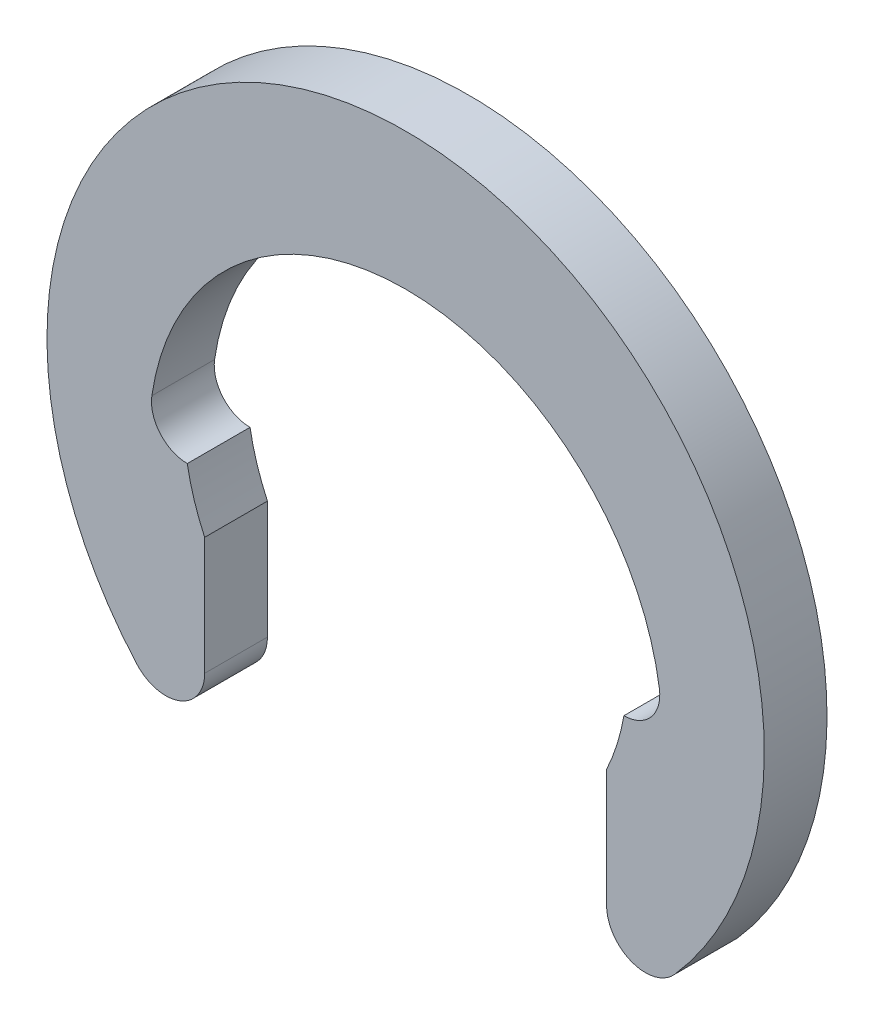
from build123d import *

# Parameters (mm, degrees)
BODY_DEPTH = 0.381


with BuildPart() as part:
    # BodySke → Body (new body)
    with BuildSketch(Plane.XY):
        with BuildLine():
            Line((1.220071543, -0.568928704), (1.220071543, -1.283926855))
            ThreePointArc((1.220071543, -1.283926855), (1.3727923, -1.504896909), (1.633480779, -1.440144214))
            ThreePointArc((1.633480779, -1.440144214), (0, 2.177676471), (-1.633480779, -1.440144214))
            ThreePointArc((-1.633480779, -1.440144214), (-1.3727923, -1.504896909), (-1.220071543, -1.283926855))
            Line((-1.220071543, -1.283926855), (-1.220071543, -0.568928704))
            ThreePointArc((-1.220071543, -0.568928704), (-1.283893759, -0.404810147), (-1.325748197, -0.233765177))
            ThreePointArc((-1.325748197, -0.233765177), (-1.490305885, -0.158456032), (-1.540877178, 0.015306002))
            ThreePointArc((-1.540877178, 0.015306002), (0, 1.3462), (1.540877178, 0.015306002))
            ThreePointArc((1.540877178, 0.015306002), (1.490305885, -0.158456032), (1.325748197, -0.233765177))
            ThreePointArc((1.325748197, -0.233765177), (1.283893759, -0.404810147), (1.220071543, -0.568928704))
        make_face()
    extrude(amount=-BODY_DEPTH)


solid = part.part
